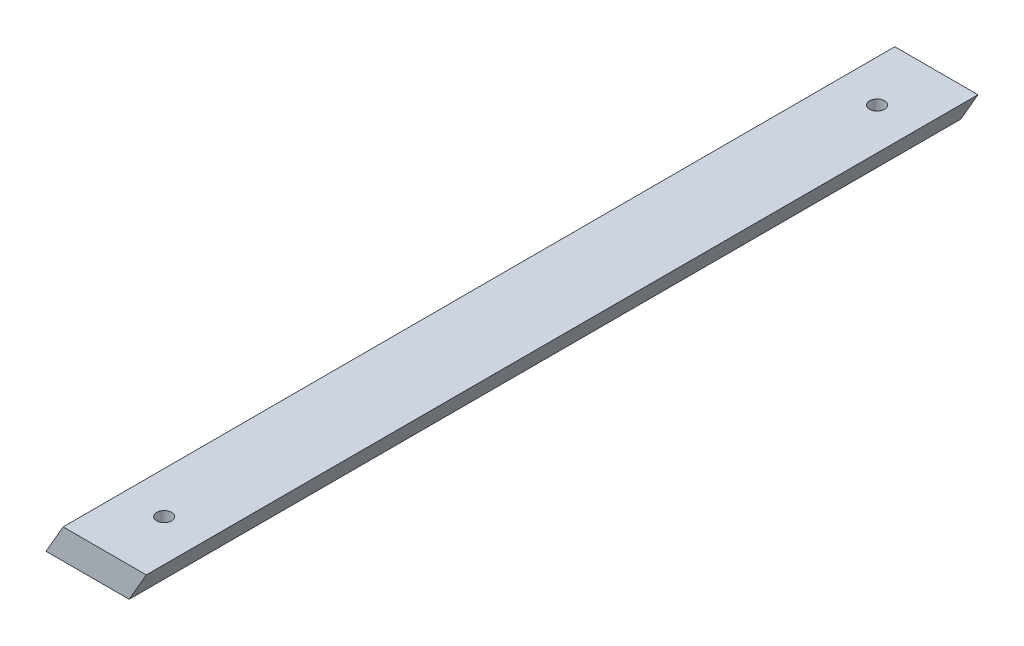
from build123d import *

# Parameters (mm, degrees)
BOSS_EXTRUDE1_DEPTH = 140
SKETCH2_R           = 2.5
CUT_EXTRUDE1_DEPTH  = 142.742694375


with BuildPart() as part:
    # Sketch1 → Boss-Extrude1 (new, symmetric)
    with BuildSketch(Plane.XY):
        Polygon((-14, 5), (-19.773502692, -5), (-14, -5), align=None)
        Polygon((8.226497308, -5), (14, 5), (-14, 5), (-14, -5), align=None)
    extrude(amount=BOSS_EXTRUDE1_DEPTH, both=True)

    # Sketch2 → Cut-Extrude1 (cut, through all)
    with BuildSketch(Plane(origin=(0, 5, 0), x_dir=(1, 0, 0), z_dir=(0, 1, 0))):
        with Locations(Location((0, -120, 0), (0, 0, 180))):
            Circle(SKETCH2_R)
    cut_extrude1 = extrude(amount=-CUT_EXTRUDE1_DEPTH, mode=Mode.SUBTRACT)

    # Mirror1: Cut-Extrude1 across plane
    add(cut_extrude1.mirror(Plane.XY), mode=Mode.SUBTRACT)


solid = part.part
